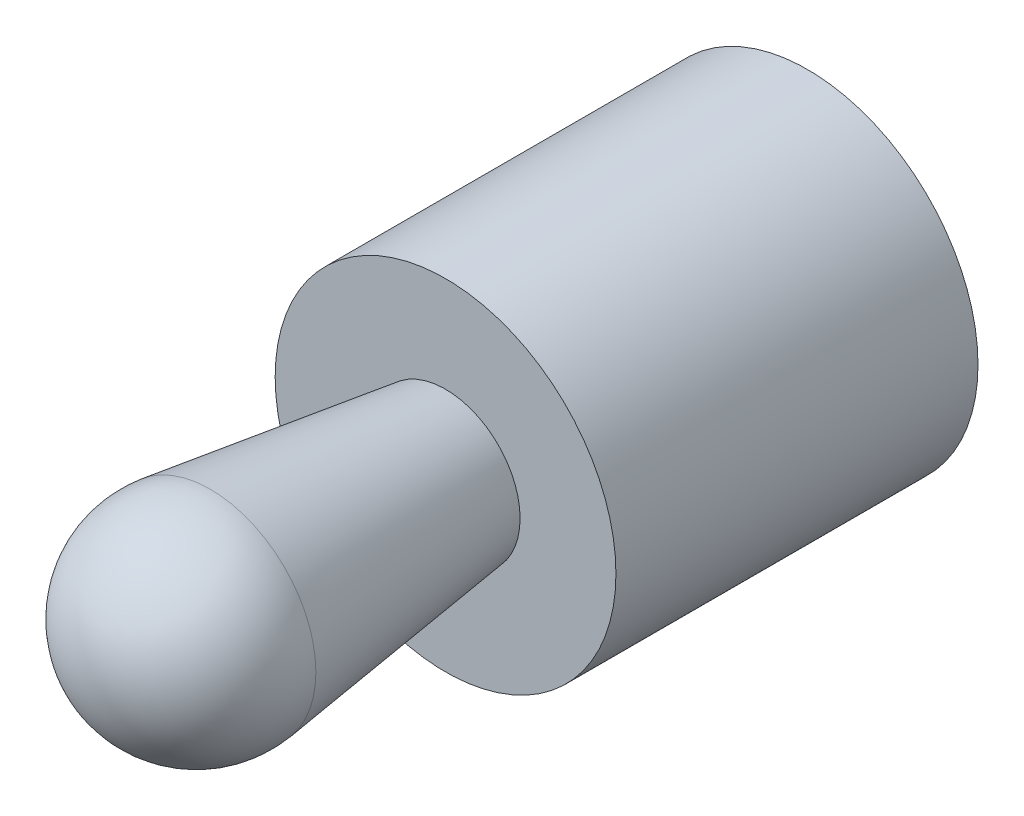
ISO-10303-21;
HEADER;
FILE_DESCRIPTION(('STEP AP214'),'2;1');
FILE_NAME('part.step','',(''),(''),'','','');
FILE_SCHEMA(('AUTOMOTIVE_DESIGN { 1 0 10303 214 1 1 1 1 }'));
ENDSEC;
DATA;
#1=APPLICATION_CONTEXT('core data for automotive mechanical design processes');
#2=APPLICATION_PROTOCOL_DEFINITION('international standard','automotive_design',2000,#1);
#3=PRODUCT_CONTEXT('',#1,'mechanical');
#4=PRODUCT('Part','Part','',(#3));
#5=PRODUCT_RELATED_PRODUCT_CATEGORY('part','',(#4));
#6=PRODUCT_DEFINITION_FORMATION('','',#4);
#7=PRODUCT_DEFINITION_CONTEXT('part definition',#1,'design');
#8=PRODUCT_DEFINITION('design','',#6,#7);
#9=PRODUCT_DEFINITION_SHAPE('','',#8);
#10=(LENGTH_UNIT() NAMED_UNIT(*) SI_UNIT(.MILLI.,.METRE.));
#11=(NAMED_UNIT(*) PLANE_ANGLE_UNIT() SI_UNIT($,.RADIAN.));
#12=(NAMED_UNIT(*) SI_UNIT($,.STERADIAN.) SOLID_ANGLE_UNIT());
#13=UNCERTAINTY_MEASURE_WITH_UNIT(LENGTH_MEASURE(1.E-05),#10,'distance_accuracy_value','');
#14=(GEOMETRIC_REPRESENTATION_CONTEXT(3) GLOBAL_UNCERTAINTY_ASSIGNED_CONTEXT((#13)) GLOBAL_UNIT_ASSIGNED_CONTEXT((#10,
#11,#12)) REPRESENTATION_CONTEXT('',''));
#15=CARTESIAN_POINT('',(0.,0.,0.));
#16=DIRECTION('',(0.,0.,1.));
#17=DIRECTION('',(1.,0.,0.));
#18=AXIS2_PLACEMENT_3D('',#15,#16,#17);
#19=CARTESIAN_POINT('',(0.,0.,0.));
#20=DIRECTION('',(0.,0.,1.));
#21=DIRECTION('',(1.,0.,0.));
#22=AXIS2_PLACEMENT_3D('',#19,#20,#21);
#23=PLANE('',#22);
#24=CARTESIAN_POINT('',(0.,0.,0.));
#25=DIRECTION('',(0.,0.,1.));
#26=DIRECTION('',(1.,0.,0.));
#27=AXIS2_PLACEMENT_3D('',#24,#25,#26);
#28=CIRCLE('',#27,8.);
#29=CARTESIAN_POINT('',(8.,0.,0.));
#30=VERTEX_POINT('',#29);
#31=EDGE_CURVE('E8',#30,#30,#28,.T.);
#32=ORIENTED_EDGE('',*,*,#31,.F.);
#33=EDGE_LOOP('',(#32));
#34=FACE_BOUND('',#33,.T.);
#35=ADVANCED_FACE('F12',(#34),#23,.F.);
#36=CARTESIAN_POINT('',(0.,0.,20.));
#37=DIRECTION('',(0.,0.,1.));
#38=DIRECTION('',(1.,0.,0.));
#39=AXIS2_PLACEMENT_3D('',#36,#37,#38);
#40=CYLINDRICAL_SURFACE('',#39,8.);
#41=CARTESIAN_POINT('',(0.,0.,17.));
#42=DIRECTION('',(0.,0.,1.));
#43=DIRECTION('',(1.,0.,0.));
#44=AXIS2_PLACEMENT_3D('',#41,#42,#43);
#45=CIRCLE('',#44,8.);
#46=CARTESIAN_POINT('',(8.,0.,17.));
#47=VERTEX_POINT('',#46);
#48=EDGE_CURVE('E18',#47,#47,#45,.T.);
#49=ORIENTED_EDGE('',*,*,#48,.F.);
#50=EDGE_LOOP('',(#49));
#51=FACE_BOUND('',#50,.T.);
#52=ORIENTED_EDGE('',*,*,#31,.T.);
#53=EDGE_LOOP('',(#52));
#54=FACE_BOUND('',#53,.T.);
#55=ADVANCED_FACE('F45',(#51,#54),#40,.T.);
#56=CARTESIAN_POINT('',(-3.5,0.,17.));
#57=DIRECTION('',(0.,0.,1.));
#58=DIRECTION('',(1.,0.,0.));
#59=AXIS2_PLACEMENT_3D('',#56,#57,#58);
#60=PLANE('',#59);
#61=ORIENTED_EDGE('',*,*,#48,.T.);
#62=EDGE_LOOP('',(#61));
#63=FACE_BOUND('',#62,.T.);
#64=CARTESIAN_POINT('',(0.,0.,17.));
#65=DIRECTION('',(0.,0.,1.));
#66=DIRECTION('',(1.,0.,0.));
#67=AXIS2_PLACEMENT_3D('',#64,#65,#66);
#68=CIRCLE('',#67,3.5);
#69=CARTESIAN_POINT('',(3.5,0.,17.));
#70=VERTEX_POINT('',#69);
#71=EDGE_CURVE('E22',#70,#70,#68,.T.);
#72=ORIENTED_EDGE('',*,*,#71,.F.);
#73=EDGE_LOOP('',(#72));
#74=FACE_BOUND('',#73,.T.);
#75=ADVANCED_FACE('F36',(#63,#74),#60,.T.);
#76=CARTESIAN_POINT('',(0.,0.,28.0461293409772));
#77=DIRECTION('',(0.,0.,1.));
#78=DIRECTION('',(1.,0.,0.));
#79=AXIS2_PLACEMENT_3D('',#76,#77,#78);
#80=CONICAL_SURFACE('',#79,4.95706093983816,0.131149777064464);
#81=ORIENTED_EDGE('',*,*,#71,.T.);
#82=EDGE_LOOP('',(#81));
#83=FACE_BOUND('',#82,.T.);
#84=CARTESIAN_POINT('',(0.,0.,28.0461293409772));
#85=DIRECTION('',(0.,0.,1.));
#86=DIRECTION('',(1.,0.,0.));
#87=AXIS2_PLACEMENT_3D('',#84,#85,#86);
#88=CIRCLE('',#87,4.95706093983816);
#89=CARTESIAN_POINT('',(4.95706093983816,0.,28.0461293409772));
#90=VERTEX_POINT('',#89);
#91=EDGE_CURVE('E26',#90,#90,#88,.T.);
#92=ORIENTED_EDGE('',*,*,#91,.F.);
#93=EDGE_LOOP('',(#92));
#94=FACE_BOUND('',#93,.T.);
#95=ADVANCED_FACE('F34',(#83,#94),#80,.T.);
#96=CARTESIAN_POINT('',(0.,0.,28.7));
#97=DIRECTION('',(0.,0.,1.));
#98=DIRECTION('',(1.,0.,0.));
#99=AXIS2_PLACEMENT_3D('',#96,#97,#98);
#100=SPHERICAL_SURFACE('',#99,5.);
#101=ORIENTED_EDGE('',*,*,#91,.T.);
#102=EDGE_LOOP('',(#101));
#103=FACE_BOUND('',#102,.T.);
#104=ADVANCED_FACE('F32',(#103),#100,.T.);
#105=CLOSED_SHELL('',(#35,#55,#75,#95,#104));
#106=MANIFOLD_SOLID_BREP('B1',#105);
#107=ADVANCED_BREP_SHAPE_REPRESENTATION('',(#18,#106),#14);
#108=SHAPE_DEFINITION_REPRESENTATION(#9,#107);
ENDSEC;
END-ISO-10303-21;
